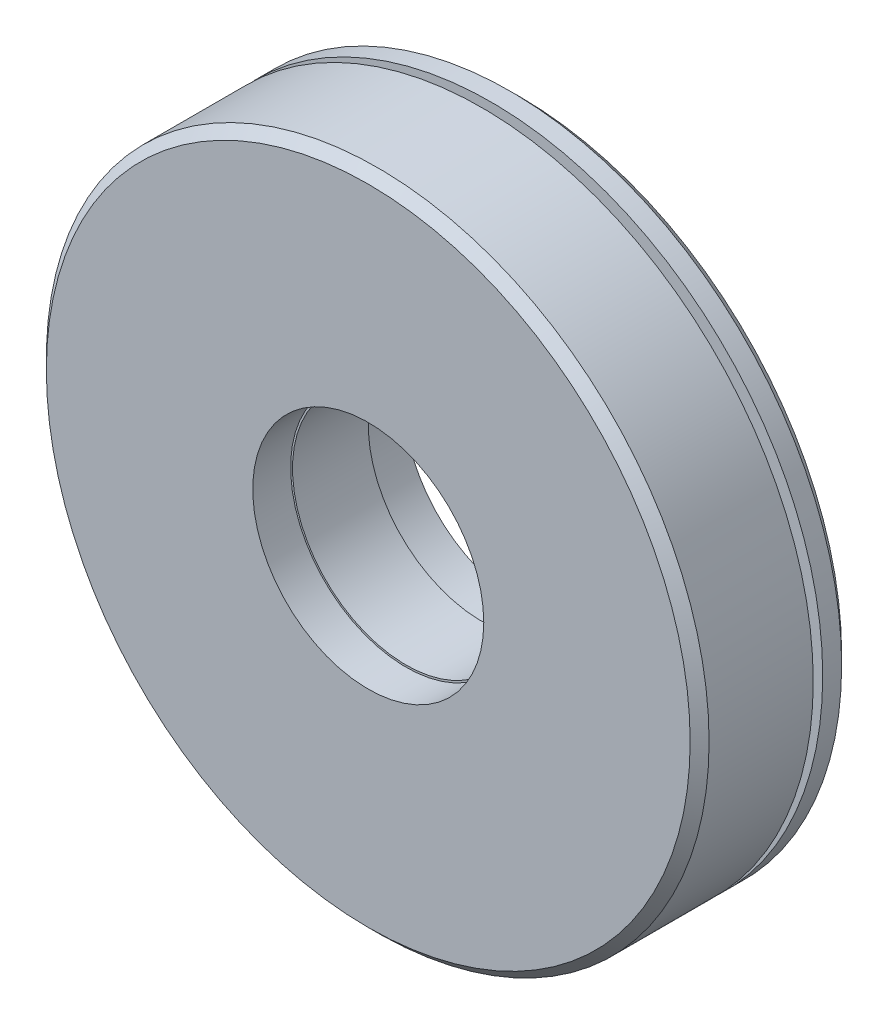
ISO-10303-21;
HEADER;
FILE_DESCRIPTION(('STEP AP214'),'2;1');
FILE_NAME('part.step','',(''),(''),'','','');
FILE_SCHEMA(('AUTOMOTIVE_DESIGN { 1 0 10303 214 1 1 1 1 }'));
ENDSEC;
DATA;
#1=APPLICATION_CONTEXT('core data for automotive mechanical design processes');
#2=APPLICATION_PROTOCOL_DEFINITION('international standard','automotive_design',2000,#1);
#3=PRODUCT_CONTEXT('',#1,'mechanical');
#4=PRODUCT('Part','Part','',(#3));
#5=PRODUCT_RELATED_PRODUCT_CATEGORY('part','',(#4));
#6=PRODUCT_DEFINITION_FORMATION('','',#4);
#7=PRODUCT_DEFINITION_CONTEXT('part definition',#1,'design');
#8=PRODUCT_DEFINITION('design','',#6,#7);
#9=PRODUCT_DEFINITION_SHAPE('','',#8);
#10=(LENGTH_UNIT() NAMED_UNIT(*) SI_UNIT(.MILLI.,.METRE.));
#11=(NAMED_UNIT(*) PLANE_ANGLE_UNIT() SI_UNIT($,.RADIAN.));
#12=(NAMED_UNIT(*) SI_UNIT($,.STERADIAN.) SOLID_ANGLE_UNIT());
#13=UNCERTAINTY_MEASURE_WITH_UNIT(LENGTH_MEASURE(1.E-05),#10,'distance_accuracy_value','');
#14=(GEOMETRIC_REPRESENTATION_CONTEXT(3) GLOBAL_UNCERTAINTY_ASSIGNED_CONTEXT((#13)) GLOBAL_UNIT_ASSIGNED_CONTEXT((#10,
#11,#12)) REPRESENTATION_CONTEXT('',''));
#15=CARTESIAN_POINT('',(0.,0.,0.));
#16=DIRECTION('',(0.,0.,1.));
#17=DIRECTION('',(1.,0.,0.));
#18=AXIS2_PLACEMENT_3D('',#15,#16,#17);
#19=CARTESIAN_POINT('',(0.,0.,7.5));
#20=DIRECTION('',(0.,0.,-1.));
#21=DIRECTION('',(-1.,0.,0.));
#22=AXIS2_PLACEMENT_3D('',#19,#20,#21);
#23=CONICAL_SURFACE('',#22,17.5,0.785398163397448);
#24=CARTESIAN_POINT('',(0.,0.,8.));
#25=DIRECTION('',(0.,0.,1.));
#26=DIRECTION('',(1.,0.,0.));
#27=AXIS2_PLACEMENT_3D('',#24,#25,#26);
#28=CIRCLE('',#27,17.);
#29=CARTESIAN_POINT('',(17.,0.,8.));
#30=VERTEX_POINT('',#29);
#31=EDGE_CURVE('E8',#30,#30,#28,.T.);
#32=ORIENTED_EDGE('',*,*,#31,.F.);
#33=EDGE_LOOP('',(#32));
#34=FACE_BOUND('',#33,.T.);
#35=CARTESIAN_POINT('',(0.,0.,7.5));
#36=DIRECTION('',(0.,0.,1.));
#37=DIRECTION('',(1.,0.,0.));
#38=AXIS2_PLACEMENT_3D('',#35,#36,#37);
#39=CIRCLE('',#38,17.5);
#40=CARTESIAN_POINT('',(17.5,0.,7.5));
#41=VERTEX_POINT('',#40);
#42=EDGE_CURVE('E59',#41,#41,#39,.T.);
#43=ORIENTED_EDGE('',*,*,#42,.T.);
#44=EDGE_LOOP('',(#43));
#45=FACE_BOUND('',#44,.T.);
#46=ADVANCED_FACE('F13',(#34,#45),#23,.T.);
#47=CARTESIAN_POINT('',(0.,17.,8.));
#48=DIRECTION('',(0.,0.,-1.));
#49=DIRECTION('',(-1.,0.,0.));
#50=AXIS2_PLACEMENT_3D('',#47,#48,#49);
#51=PLANE('',#50);
#52=CARTESIAN_POINT('',(0.,0.,8.));
#53=DIRECTION('',(0.,0.,1.));
#54=DIRECTION('',(1.,0.,0.));
#55=AXIS2_PLACEMENT_3D('',#52,#53,#54);
#56=CIRCLE('',#55,6.1);
#57=CARTESIAN_POINT('',(6.1,0.,8.));
#58=VERTEX_POINT('',#57);
#59=EDGE_CURVE('E19',#58,#58,#56,.T.);
#60=ORIENTED_EDGE('',*,*,#59,.F.);
#61=EDGE_LOOP('',(#60));
#62=FACE_BOUND('',#61,.T.);
#63=ORIENTED_EDGE('',*,*,#31,.T.);
#64=EDGE_LOOP('',(#63));
#65=FACE_BOUND('',#64,.T.);
#66=ADVANCED_FACE('F132',(#62,#65),#51,.F.);
#67=CARTESIAN_POINT('',(0.,0.,0.));
#68=DIRECTION('',(0.,0.,1.));
#69=DIRECTION('',(1.,0.,0.));
#70=AXIS2_PLACEMENT_3D('',#67,#68,#69);
#71=CYLINDRICAL_SURFACE('',#70,6.1);
#72=CARTESIAN_POINT('',(0.,0.,6.));
#73=DIRECTION('',(0.,0.,1.));
#74=DIRECTION('',(1.,0.,0.));
#75=AXIS2_PLACEMENT_3D('',#72,#73,#74);
#76=CIRCLE('',#75,6.1);
#77=CARTESIAN_POINT('',(6.1,0.,6.));
#78=VERTEX_POINT('',#77);
#79=EDGE_CURVE('E23',#78,#78,#76,.T.);
#80=ORIENTED_EDGE('',*,*,#79,.F.);
#81=EDGE_LOOP('',(#80));
#82=FACE_BOUND('',#81,.T.);
#83=ORIENTED_EDGE('',*,*,#59,.T.);
#84=EDGE_LOOP('',(#83));
#85=FACE_BOUND('',#84,.T.);
#86=ADVANCED_FACE('F127',(#82,#85),#71,.F.);
#87=CARTESIAN_POINT('',(0.,6.1,6.));
#88=DIRECTION('',(0.,0.,-1.));
#89=DIRECTION('',(-1.,0.,0.));
#90=AXIS2_PLACEMENT_3D('',#87,#88,#89);
#91=PLANE('',#90);
#92=CARTESIAN_POINT('',(0.,0.,6.));
#93=DIRECTION('',(0.,0.,1.));
#94=DIRECTION('',(1.,0.,0.));
#95=AXIS2_PLACEMENT_3D('',#92,#93,#94);
#96=CIRCLE('',#95,6.);
#97=CARTESIAN_POINT('',(6.,0.,6.));
#98=VERTEX_POINT('',#97);
#99=EDGE_CURVE('E27',#98,#98,#96,.T.);
#100=ORIENTED_EDGE('',*,*,#99,.F.);
#101=EDGE_LOOP('',(#100));
#102=FACE_BOUND('',#101,.T.);
#103=ORIENTED_EDGE('',*,*,#79,.T.);
#104=EDGE_LOOP('',(#103));
#105=FACE_BOUND('',#104,.T.);
#106=ADVANCED_FACE('F121',(#102,#105),#91,.F.);
#107=CARTESIAN_POINT('',(0.,0.,0.));
#108=DIRECTION('',(0.,0.,1.));
#109=DIRECTION('',(1.,0.,0.));
#110=AXIS2_PLACEMENT_3D('',#107,#108,#109);
#111=CYLINDRICAL_SURFACE('',#110,6.);
#112=CARTESIAN_POINT('',(0.,0.,2.));
#113=DIRECTION('',(0.,0.,1.));
#114=DIRECTION('',(1.,0.,0.));
#115=AXIS2_PLACEMENT_3D('',#112,#113,#114);
#116=CIRCLE('',#115,6.);
#117=CARTESIAN_POINT('',(6.,0.,2.));
#118=VERTEX_POINT('',#117);
#119=EDGE_CURVE('E32',#118,#118,#116,.T.);
#120=ORIENTED_EDGE('',*,*,#119,.F.);
#121=EDGE_LOOP('',(#120));
#122=FACE_BOUND('',#121,.T.);
#123=ORIENTED_EDGE('',*,*,#99,.T.);
#124=EDGE_LOOP('',(#123));
#125=FACE_BOUND('',#124,.T.);
#126=ADVANCED_FACE('F115',(#122,#125),#111,.F.);
#127=CARTESIAN_POINT('',(0.,6.,2.));
#128=DIRECTION('',(0.,0.,1.));
#129=DIRECTION('',(1.,0.,0.));
#130=AXIS2_PLACEMENT_3D('',#127,#128,#129);
#131=PLANE('',#130);
#132=CARTESIAN_POINT('',(0.,0.,2.));
#133=DIRECTION('',(0.,0.,1.));
#134=DIRECTION('',(1.,0.,0.));
#135=AXIS2_PLACEMENT_3D('',#132,#133,#134);
#136=CIRCLE('',#135,6.1);
#137=CARTESIAN_POINT('',(6.1,0.,2.));
#138=VERTEX_POINT('',#137);
#139=EDGE_CURVE('E35',#138,#138,#136,.T.);
#140=ORIENTED_EDGE('',*,*,#139,.F.);
#141=EDGE_LOOP('',(#140));
#142=FACE_BOUND('',#141,.T.);
#143=ORIENTED_EDGE('',*,*,#119,.T.);
#144=EDGE_LOOP('',(#143));
#145=FACE_BOUND('',#144,.T.);
#146=ADVANCED_FACE('F109',(#142,#145),#131,.F.);
#147=CARTESIAN_POINT('',(0.,0.,0.));
#148=DIRECTION('',(0.,0.,1.));
#149=DIRECTION('',(1.,0.,0.));
#150=AXIS2_PLACEMENT_3D('',#147,#148,#149);
#151=CYLINDRICAL_SURFACE('',#150,6.1);
#152=CARTESIAN_POINT('',(0.,0.,0.));
#153=DIRECTION('',(0.,0.,1.));
#154=DIRECTION('',(1.,0.,0.));
#155=AXIS2_PLACEMENT_3D('',#152,#153,#154);
#156=CIRCLE('',#155,6.1);
#157=CARTESIAN_POINT('',(6.1,0.,0.));
#158=VERTEX_POINT('',#157);
#159=EDGE_CURVE('E38',#158,#158,#156,.T.);
#160=ORIENTED_EDGE('',*,*,#159,.F.);
#161=EDGE_LOOP('',(#160));
#162=FACE_BOUND('',#161,.T.);
#163=ORIENTED_EDGE('',*,*,#139,.T.);
#164=EDGE_LOOP('',(#163));
#165=FACE_BOUND('',#164,.T.);
#166=ADVANCED_FACE('F103',(#162,#165),#151,.F.);
#167=CARTESIAN_POINT('',(0.,6.1,0.));
#168=DIRECTION('',(0.,0.,1.));
#169=DIRECTION('',(1.,0.,0.));
#170=AXIS2_PLACEMENT_3D('',#167,#168,#169);
#171=PLANE('',#170);
#172=CARTESIAN_POINT('',(0.,0.,0.));
#173=DIRECTION('',(0.,0.,1.));
#174=DIRECTION('',(1.,0.,0.));
#175=AXIS2_PLACEMENT_3D('',#172,#173,#174);
#176=CIRCLE('',#175,17.);
#177=CARTESIAN_POINT('',(17.,0.,0.));
#178=VERTEX_POINT('',#177);
#179=EDGE_CURVE('E41',#178,#178,#176,.T.);
#180=ORIENTED_EDGE('',*,*,#179,.F.);
#181=EDGE_LOOP('',(#180));
#182=FACE_BOUND('',#181,.T.);
#183=ORIENTED_EDGE('',*,*,#159,.T.);
#184=EDGE_LOOP('',(#183));
#185=FACE_BOUND('',#184,.T.);
#186=ADVANCED_FACE('F97',(#182,#185),#171,.F.);
#187=CARTESIAN_POINT('',(0.,0.,0.));
#188=DIRECTION('',(0.,0.,1.));
#189=DIRECTION('',(1.,0.,0.));
#190=AXIS2_PLACEMENT_3D('',#187,#188,#189);
#191=CONICAL_SURFACE('',#190,17.,0.785398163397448);
#192=CARTESIAN_POINT('',(0.,0.,0.5));
#193=DIRECTION('',(0.,0.,1.));
#194=DIRECTION('',(1.,0.,0.));
#195=AXIS2_PLACEMENT_3D('',#192,#193,#194);
#196=CIRCLE('',#195,17.5);
#197=CARTESIAN_POINT('',(17.5,0.,0.5));
#198=VERTEX_POINT('',#197);
#199=EDGE_CURVE('E44',#198,#198,#196,.T.);
#200=ORIENTED_EDGE('',*,*,#199,.F.);
#201=EDGE_LOOP('',(#200));
#202=FACE_BOUND('',#201,.T.);
#203=ORIENTED_EDGE('',*,*,#179,.T.);
#204=EDGE_LOOP('',(#203));
#205=FACE_BOUND('',#204,.T.);
#206=ADVANCED_FACE('F91',(#202,#205),#191,.T.);
#207=CARTESIAN_POINT('',(0.,0.,0.));
#208=DIRECTION('',(0.,0.,1.));
#209=DIRECTION('',(1.,0.,0.));
#210=AXIS2_PLACEMENT_3D('',#207,#208,#209);
#211=CYLINDRICAL_SURFACE('',#210,17.5);
#212=CARTESIAN_POINT('',(0.,0.,1.5));
#213=DIRECTION('',(0.,0.,1.));
#214=DIRECTION('',(1.,0.,0.));
#215=AXIS2_PLACEMENT_3D('',#212,#213,#214);
#216=CIRCLE('',#215,17.5);
#217=CARTESIAN_POINT('',(17.5,0.,1.5));
#218=VERTEX_POINT('',#217);
#219=EDGE_CURVE('E47',#218,#218,#216,.T.);
#220=ORIENTED_EDGE('',*,*,#219,.F.);
#221=EDGE_LOOP('',(#220));
#222=FACE_BOUND('',#221,.T.);
#223=ORIENTED_EDGE('',*,*,#199,.T.);
#224=EDGE_LOOP('',(#223));
#225=FACE_BOUND('',#224,.T.);
#226=ADVANCED_FACE('F85',(#222,#225),#211,.T.);
#227=CARTESIAN_POINT('',(0.,17.5,1.5));
#228=DIRECTION('',(0.,0.,-1.));
#229=DIRECTION('',(-1.,0.,0.));
#230=AXIS2_PLACEMENT_3D('',#227,#228,#229);
#231=PLANE('',#230);
#232=CARTESIAN_POINT('',(0.,0.,1.5));
#233=DIRECTION('',(0.,0.,1.));
#234=DIRECTION('',(1.,0.,0.));
#235=AXIS2_PLACEMENT_3D('',#232,#233,#234);
#236=CIRCLE('',#235,14.85);
#237=CARTESIAN_POINT('',(14.85,0.,1.5));
#238=VERTEX_POINT('',#237);
#239=EDGE_CURVE('E50',#238,#238,#236,.T.);
#240=ORIENTED_EDGE('',*,*,#239,.F.);
#241=EDGE_LOOP('',(#240));
#242=FACE_BOUND('',#241,.T.);
#243=ORIENTED_EDGE('',*,*,#219,.T.);
#244=EDGE_LOOP('',(#243));
#245=FACE_BOUND('',#244,.T.);
#246=ADVANCED_FACE('F79',(#242,#245),#231,.F.);
#247=CARTESIAN_POINT('',(0.,0.,0.));
#248=DIRECTION('',(0.,0.,1.));
#249=DIRECTION('',(1.,0.,0.));
#250=AXIS2_PLACEMENT_3D('',#247,#248,#249);
#251=CYLINDRICAL_SURFACE('',#250,14.85);
#252=CARTESIAN_POINT('',(0.,0.,2.));
#253=DIRECTION('',(0.,0.,1.));
#254=DIRECTION('',(1.,0.,0.));
#255=AXIS2_PLACEMENT_3D('',#252,#253,#254);
#256=CIRCLE('',#255,14.85);
#257=CARTESIAN_POINT('',(14.85,0.,2.));
#258=VERTEX_POINT('',#257);
#259=EDGE_CURVE('E53',#258,#258,#256,.T.);
#260=ORIENTED_EDGE('',*,*,#259,.F.);
#261=EDGE_LOOP('',(#260));
#262=FACE_BOUND('',#261,.T.);
#263=ORIENTED_EDGE('',*,*,#239,.T.);
#264=EDGE_LOOP('',(#263));
#265=FACE_BOUND('',#264,.T.);
#266=ADVANCED_FACE('F73',(#262,#265),#251,.T.);
#267=CARTESIAN_POINT('',(0.,14.85,2.));
#268=DIRECTION('',(0.,0.,1.));
#269=DIRECTION('',(1.,0.,0.));
#270=AXIS2_PLACEMENT_3D('',#267,#268,#269);
#271=PLANE('',#270);
#272=CARTESIAN_POINT('',(0.,0.,2.));
#273=DIRECTION('',(0.,0.,1.));
#274=DIRECTION('',(1.,0.,0.));
#275=AXIS2_PLACEMENT_3D('',#272,#273,#274);
#276=CIRCLE('',#275,17.5);
#277=CARTESIAN_POINT('',(17.5,0.,2.));
#278=VERTEX_POINT('',#277);
#279=EDGE_CURVE('E56',#278,#278,#276,.T.);
#280=ORIENTED_EDGE('',*,*,#279,.F.);
#281=EDGE_LOOP('',(#280));
#282=FACE_BOUND('',#281,.T.);
#283=ORIENTED_EDGE('',*,*,#259,.T.);
#284=EDGE_LOOP('',(#283));
#285=FACE_BOUND('',#284,.T.);
#286=ADVANCED_FACE('F67',(#282,#285),#271,.F.);
#287=CARTESIAN_POINT('',(0.,0.,0.));
#288=DIRECTION('',(0.,0.,1.));
#289=DIRECTION('',(1.,0.,0.));
#290=AXIS2_PLACEMENT_3D('',#287,#288,#289);
#291=CYLINDRICAL_SURFACE('',#290,17.5);
#292=ORIENTED_EDGE('',*,*,#42,.F.);
#293=EDGE_LOOP('',(#292));
#294=FACE_BOUND('',#293,.T.);
#295=ORIENTED_EDGE('',*,*,#279,.T.);
#296=EDGE_LOOP('',(#295));
#297=FACE_BOUND('',#296,.T.);
#298=ADVANCED_FACE('F64',(#294,#297),#291,.T.);
#299=CLOSED_SHELL('',(#46,#66,#86,#106,#126,#146,#166,#186,#206,#226,#246,#266,#286,#298));
#300=MANIFOLD_SOLID_BREP('B1',#299);
#301=ADVANCED_BREP_SHAPE_REPRESENTATION('',(#18,#300),#14);
#302=SHAPE_DEFINITION_REPRESENTATION(#9,#301);
ENDSEC;
END-ISO-10303-21;
